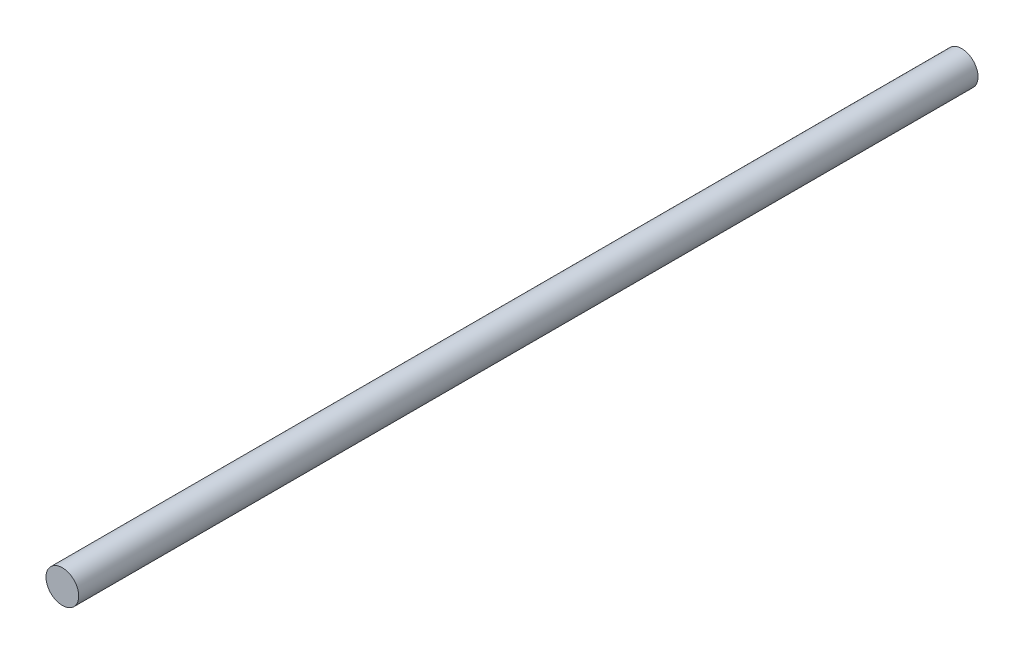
ISO-10303-21;
HEADER;
FILE_DESCRIPTION(('STEP AP214'),'2;1');
FILE_NAME('part.step','',(''),(''),'','','');
FILE_SCHEMA(('AUTOMOTIVE_DESIGN { 1 0 10303 214 1 1 1 1 }'));
ENDSEC;
DATA;
#1=APPLICATION_CONTEXT('core data for automotive mechanical design processes');
#2=APPLICATION_PROTOCOL_DEFINITION('international standard','automotive_design',2000,#1);
#3=PRODUCT_CONTEXT('',#1,'mechanical');
#4=PRODUCT('Part','Part','',(#3));
#5=PRODUCT_RELATED_PRODUCT_CATEGORY('part','',(#4));
#6=PRODUCT_DEFINITION_FORMATION('','',#4);
#7=PRODUCT_DEFINITION_CONTEXT('part definition',#1,'design');
#8=PRODUCT_DEFINITION('design','',#6,#7);
#9=PRODUCT_DEFINITION_SHAPE('','',#8);
#10=(LENGTH_UNIT() NAMED_UNIT(*) SI_UNIT(.MILLI.,.METRE.));
#11=(NAMED_UNIT(*) PLANE_ANGLE_UNIT() SI_UNIT($,.RADIAN.));
#12=(NAMED_UNIT(*) SI_UNIT($,.STERADIAN.) SOLID_ANGLE_UNIT());
#13=UNCERTAINTY_MEASURE_WITH_UNIT(LENGTH_MEASURE(1.E-05),#10,'distance_accuracy_value','');
#14=(GEOMETRIC_REPRESENTATION_CONTEXT(3) GLOBAL_UNCERTAINTY_ASSIGNED_CONTEXT((#13)) GLOBAL_UNIT_ASSIGNED_CONTEXT((#10,
#11,#12)) REPRESENTATION_CONTEXT('',''));
#15=CARTESIAN_POINT('',(0.,0.,0.));
#16=DIRECTION('',(0.,0.,1.));
#17=DIRECTION('',(1.,0.,0.));
#18=AXIS2_PLACEMENT_3D('',#15,#16,#17);
#19=CARTESIAN_POINT('',(0.,0.,82.4));
#20=DIRECTION('',(0.,0.,-1.));
#21=DIRECTION('',(-1.,0.,0.));
#22=AXIS2_PLACEMENT_3D('',#19,#20,#21);
#23=CYLINDRICAL_SURFACE('',#22,1.5);
#24=CARTESIAN_POINT('',(0.,0.,82.4));
#25=DIRECTION('',(0.,0.,1.));
#26=DIRECTION('',(1.,0.,0.));
#27=AXIS2_PLACEMENT_3D('',#24,#25,#26);
#28=CIRCLE('',#27,1.5);
#29=CARTESIAN_POINT('',(-1.5,0.,82.4));
#30=VERTEX_POINT('',#29);
#31=EDGE_CURVE('E10',#30,#30,#28,.T.);
#32=CARTESIAN_POINT('',(0.,0.,0.));
#33=DIRECTION('',(0.,0.,1.));
#34=DIRECTION('',(1.,0.,0.));
#35=AXIS2_PLACEMENT_3D('',#32,#33,#34);
#36=CIRCLE('',#35,1.5);
#37=CARTESIAN_POINT('',(-1.5,0.,0.));
#38=VERTEX_POINT('',#37);
#39=EDGE_CURVE('E37',#38,#38,#36,.T.);
#40=CARTESIAN_POINT('',(-1.5,0.,82.4));
#41=CARTESIAN_POINT('',(-1.5,0.,81.5416666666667));
#42=CARTESIAN_POINT('',(-1.5,0.,80.6833333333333));
#43=CARTESIAN_POINT('',(-1.5,0.,78.9666666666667));
#44=CARTESIAN_POINT('',(-1.5,0.,78.1083333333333));
#45=CARTESIAN_POINT('',(-1.5,0.,76.3916666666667));
#46=CARTESIAN_POINT('',(-1.5,0.,75.5333333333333));
#47=CARTESIAN_POINT('',(-1.5,0.,73.8166666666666));
#48=CARTESIAN_POINT('',(-1.5,0.,72.9583333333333));
#49=CARTESIAN_POINT('',(-1.5,0.,71.2416666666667));
#50=CARTESIAN_POINT('',(-1.5,0.,70.3833333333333));
#51=CARTESIAN_POINT('',(-1.5,0.,68.6666666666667));
#52=CARTESIAN_POINT('',(-1.5,0.,67.8083333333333));
#53=CARTESIAN_POINT('',(-1.5,0.,66.0916666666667));
#54=CARTESIAN_POINT('',(-1.5,0.,65.2333333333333));
#55=CARTESIAN_POINT('',(-1.5,0.,63.5166666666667));
#56=CARTESIAN_POINT('',(-1.5,0.,62.6583333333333));
#57=CARTESIAN_POINT('',(-1.5,0.,60.9416666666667));
#58=CARTESIAN_POINT('',(-1.5,0.,60.0833333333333));
#59=CARTESIAN_POINT('',(-1.5,0.,58.3666666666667));
#60=CARTESIAN_POINT('',(-1.5,0.,57.5083333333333));
#61=CARTESIAN_POINT('',(-1.5,0.,55.7916666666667));
#62=CARTESIAN_POINT('',(-1.5,0.,54.9333333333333));
#63=CARTESIAN_POINT('',(-1.5,0.,53.2166666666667));
#64=CARTESIAN_POINT('',(-1.5,0.,52.3583333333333));
#65=CARTESIAN_POINT('',(-1.5,0.,50.6416666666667));
#66=CARTESIAN_POINT('',(-1.5,0.,49.7833333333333));
#67=CARTESIAN_POINT('',(-1.5,0.,48.0666666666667));
#68=CARTESIAN_POINT('',(-1.5,0.,47.2083333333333));
#69=CARTESIAN_POINT('',(-1.5,0.,45.4916666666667));
#70=CARTESIAN_POINT('',(-1.5,0.,44.6333333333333));
#71=CARTESIAN_POINT('',(-1.5,0.,42.9166666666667));
#72=CARTESIAN_POINT('',(-1.5,0.,42.0583333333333));
#73=CARTESIAN_POINT('',(-1.5,0.,40.3416666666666));
#74=CARTESIAN_POINT('',(-1.5,0.,39.4833333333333));
#75=CARTESIAN_POINT('',(-1.5,0.,37.7666666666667));
#76=CARTESIAN_POINT('',(-1.5,0.,36.9083333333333));
#77=CARTESIAN_POINT('',(-1.5,0.,35.1916666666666));
#78=CARTESIAN_POINT('',(-1.5,0.,34.3333333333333));
#79=CARTESIAN_POINT('',(-1.5,0.,32.6166666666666));
#80=CARTESIAN_POINT('',(-1.5,0.,31.7583333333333));
#81=CARTESIAN_POINT('',(-1.5,0.,30.0416666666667));
#82=CARTESIAN_POINT('',(-1.5,0.,29.1833333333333));
#83=CARTESIAN_POINT('',(-1.5,0.,27.4666666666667));
#84=CARTESIAN_POINT('',(-1.5,0.,26.6083333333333));
#85=CARTESIAN_POINT('',(-1.5,0.,24.8916666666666));
#86=CARTESIAN_POINT('',(-1.5,0.,24.0333333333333));
#87=CARTESIAN_POINT('',(-1.5,0.,22.3166666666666));
#88=CARTESIAN_POINT('',(-1.5,0.,21.4583333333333));
#89=CARTESIAN_POINT('',(-1.5,0.,19.7416666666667));
#90=CARTESIAN_POINT('',(-1.5,0.,18.8833333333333));
#91=CARTESIAN_POINT('',(-1.5,0.,17.1666666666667));
#92=CARTESIAN_POINT('',(-1.5,0.,16.3083333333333));
#93=CARTESIAN_POINT('',(-1.5,0.,14.5916666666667));
#94=CARTESIAN_POINT('',(-1.5,0.,13.7333333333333));
#95=CARTESIAN_POINT('',(-1.5,0.,12.0166666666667));
#96=CARTESIAN_POINT('',(-1.5,0.,11.1583333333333));
#97=CARTESIAN_POINT('',(-1.5,0.,9.44166666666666));
#98=CARTESIAN_POINT('',(-1.5,0.,8.58333333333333));
#99=CARTESIAN_POINT('',(-1.5,0.,6.86666666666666));
#100=CARTESIAN_POINT('',(-1.5,0.,6.00833333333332));
#101=CARTESIAN_POINT('',(-1.5,0.,4.29166666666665));
#102=CARTESIAN_POINT('',(-1.5,0.,3.43333333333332));
#103=CARTESIAN_POINT('',(-1.5,0.,1.71666666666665));
#104=CARTESIAN_POINT('',(-1.5,0.,0.858333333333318));
#105=CARTESIAN_POINT('',(-1.5,0.,0.));
#106=B_SPLINE_CURVE_WITH_KNOTS('',3,(#40,#41,#42,#43,#44,#45,#46,#47,#48,#49,#50,#51,#52,#53,
#54,#55,#56,#57,#58,#59,#60,#61,#62,#63,#64,#65,#66,#67,#68,#69,#70,#71,#72,#73,#74,#75,#76,#77,
#78,#79,#80,#81,#82,#83,#84,#85,#86,#87,#88,#89,#90,#91,#92,#93,#94,#95,#96,#97,#98,#99,#100,
#101,#102,#103,#104,#105),.UNSPECIFIED.,.F.,.F.,(4,2,2,2,2,2,2,2,2,2,2,2,2,2,2,2,2,2,2,2,2,2,2,
2,2,2,2,2,2,2,2,2,4),(0.,2.57500000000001,5.15,7.72500000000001,10.3,12.875,15.45,18.025,20.6,
23.175,25.75,28.325,30.9,33.475,36.05,38.625,41.2,43.775,46.35,48.925,51.5,54.075,56.65,59.225,
61.8,64.375,66.95,69.525,72.1,74.675,77.25,79.825,82.4),.UNSPECIFIED.);
#107=EDGE_CURVE('BSEAM34',#30,#38,#106,.T.);
#108=ORIENTED_EDGE('',*,*,#31,.F.);
#109=ORIENTED_EDGE('',*,*,#39,.T.);
#110=ORIENTED_EDGE('',*,*,#107,.T.);
#111=ORIENTED_EDGE('',*,*,#107,.F.);
#112=EDGE_LOOP('',(#108,#110,#109,#111));
#113=FACE_BOUND('',#112,.T.);
#114=ADVANCED_FACE('F34',(#113),#23,.T.);
#115=CARTESIAN_POINT('',(0.,0.,82.4));
#116=DIRECTION('',(0.,0.,1.));
#117=DIRECTION('',(1.,0.,0.));
#118=AXIS2_PLACEMENT_3D('',#115,#116,#117);
#119=PLANE('',#118);
#120=ORIENTED_EDGE('',*,*,#31,.T.);
#121=EDGE_LOOP('',(#120));
#122=FACE_BOUND('',#121,.T.);
#123=ADVANCED_FACE('F49',(#122),#119,.T.);
#124=CARTESIAN_POINT('',(0.,0.,0.));
#125=DIRECTION('',(0.,0.,1.));
#126=DIRECTION('',(1.,0.,0.));
#127=AXIS2_PLACEMENT_3D('',#124,#125,#126);
#128=PLANE('',#127);
#129=ORIENTED_EDGE('',*,*,#39,.F.);
#130=EDGE_LOOP('',(#129));
#131=FACE_BOUND('',#130,.T.);
#132=ADVANCED_FACE('F47',(#131),#128,.F.);
#133=CLOSED_SHELL('',(#114,#123,#132));
#134=MANIFOLD_SOLID_BREP('B2',#133);
#135=ADVANCED_BREP_SHAPE_REPRESENTATION('',(#18,#134),#14);
#136=SHAPE_DEFINITION_REPRESENTATION(#9,#135);
ENDSEC;
END-ISO-10303-21;
